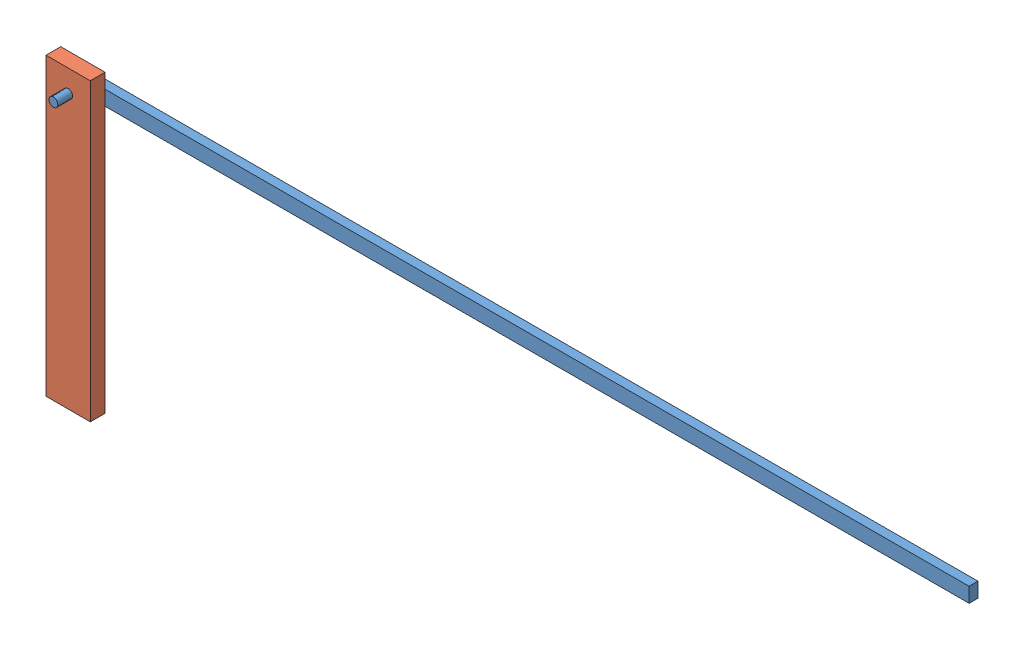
SolidWorks assembly barriere.SLDASM, configuration Défaut (file format 7000). Lengths in mm.
Overall size (3075.04 1000 130).
2 component instances, 2 part files, 2 mates.
Components (placement in the parent):
- lisse-1: lisse.SLDPRT [Défaut] at (-1499.954 -173.1881 3000) x (0.999998 0.001836 0) z (0 0 1) size (3040 50 130)
- supportLisse-1: supportLisse.SLDPRT [Défaut] at (-1535 -1073.1147 3030) size (150 1000 50)
Mates (geometry in assembly coordinates):
- Coaxiale1: concentric: cylinder of lisse-1 through (-1460 -148.1147 3130) axis (0 0 -1) radius 15; cylinder of supportLisse-1 through (-1460 -148.1147 3080) axis (0 0 -1) radius 15
- Coïncidente1: coincident: plane of lisse-1 through (-1499.954 -173.1881 3030) normal (0 0 1); plane of supportLisse-1 through (-1535 -1073.1147 3030) normal (0 0 -1)
